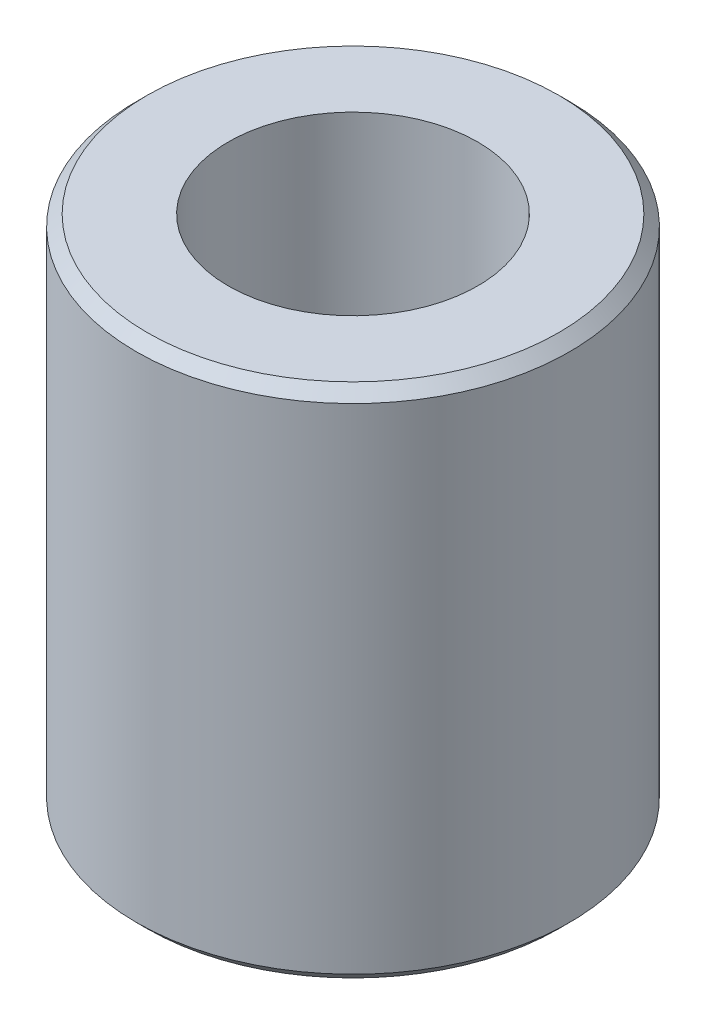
from build123d import *

# Parameters (mm, degrees)
SKETCH1_W               = 9.9949
SKETCH1_H               = 23.8125
F_1_2_20_TAPPED_HOLE1_D = 11.50874
CHAMFER1_SIZE           = 1.016
CUT_EXTRUDE1_DEPTH      = 11.1252
CHAMFER2_SIZE           = 0.508


with BuildPart() as part:
    # Sketch1 → Revolve1 (revolve)
    with BuildSketch(Plane.XY, mode=Mode.PRIVATE) as revolve1_sk:
        with Locations((-4.99745, -11.90625)):
            Rectangle(SKETCH1_W, SKETCH1_H)
    revolve(revolve1_sk.sketch.rotate(Axis((0, 12.490214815, 0), (0, -1, 0)), 270), axis=Axis((0, 12.490214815, 0), (0, -1, 0)))

    # 1_2-20 Tapped Hole1 (through all)
    with Locations(Plane(origin=(0, 0, 0), x_dir=(1, 0, 0), z_dir=(0, 1, 0))):
        with Locations((0, 0)):
            Hole(F_1_2_20_TAPPED_HOLE1_D / 2)

    # Sketch4 → Cut-Revolve1 (revolve, cut)
    with BuildSketch(Plane.XY, mode=Mode.PRIVATE) as cut_revolve1_sk:
        Polygon((-7.14375, -23.8125), (-7.14375, -11.1125), (0, -6.820101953), (0, -23.8125), align=None)
    revolve(cut_revolve1_sk.sketch.rotate(Axis((0, 4.863579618, 0), (0, -1, 0)), 270), axis=Axis((0, 4.863579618, 0), (0, -1, 0)), mode=Mode.SUBTRACT)

    # Chamfer1
    chamfer1_edges = [part.edges().sort_by_distance(p)[0] for p in [
        (0, -23.8125, -7.14375),
    ]]
    chamfer(chamfer1_edges, length=CHAMFER1_SIZE)

    # Sketch5 → Cut-Extrude1 (cut)
    with BuildSketch(Plane.XZ.offset(23.8125)):
        Polygon((8.248891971, 0), (4.124445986, 7.14375), (-4.124445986, 7.14375), (-8.248891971, 0), (-4.124445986, -7.14375), (4.124445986, -7.14375), align=None)
    extrude(amount=-CUT_EXTRUDE1_DEPTH, mode=Mode.SUBTRACT)

    # Chamfer2
    chamfer2_edges = [part.edges().sort_by_distance(p)[0] for p in [
        (0, 0, -9.9949),
        (0, -23.8125, -9.9949),
    ]]
    chamfer(chamfer2_edges, length=CHAMFER2_SIZE)


solid = part.part
